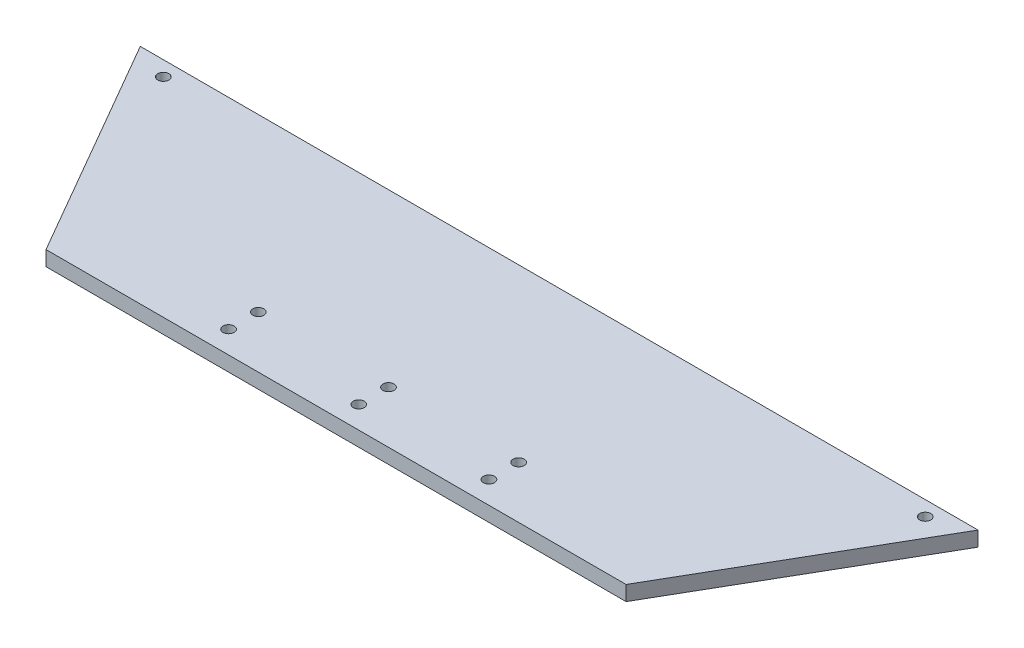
from build123d import *

# Parameters (mm, degrees)
EXTRUDE_1_DEPTH      = 4
SKETCH_6_R           = 1.5
CUT_EXTRUDE_5_DEPTH  = 20
SKETCH_7_R           = 1.5
CUT_EXTRUDE_10_DEPTH = 203.172047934


with BuildPart() as part:
    # Sketch 1 → Extrude 1 (new body)
    with BuildSketch(Plane(origin=(0, 0, 0), x_dir=(1, 0, 0), z_dir=(0, 1, 0))):
        Polygon((-78, 0), (78, 0), (112.641016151, 60), (-112.641016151, 60), align=None)
    extrude(amount=EXTRUDE_1_DEPTH)

    # Sketch 6 → Cut-Extrude 5 (cut)
    with BuildSketch(Plane(origin=(24.286369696, -3, 75), x_dir=(-1, 0, 0), z_dir=(0, -1, 0))):
        with Locations(Location((-78.169601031, 131, 0), (0, 0, 270))):
            Circle(SKETCH_6_R)
        with Locations(Location((126.742340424, 131, 0), (0, 0, 270))):
            Circle(SKETCH_6_R)
    extrude(amount=-CUT_EXTRUDE_5_DEPTH, mode=Mode.SUBTRACT)

    # Sketch 7 → Cut-Extrude 10 (cut, through all)
    with BuildSketch(Plane(origin=(0, -152.797762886, 0), x_dir=(-1, 0, 0), z_dir=(0, -1, 0))):
        with Locations(Location((-35.106818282, 14, 0), (0, 0, 90))):
            Circle(SKETCH_7_R)
        with Locations(Location((-0.106818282, 14, 0), (0, 0, 90))):
            Circle(SKETCH_7_R)
        with Locations(Location((34.893181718, 14, 0), (0, 0, 90))):
            Circle(SKETCH_7_R)
        with Locations(Location((34.893181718, 6, 0), (0, 0, 90))):
            Circle(SKETCH_7_R)
        with Locations(Location((-0.106818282, 6, 0), (0, 0, 90))):
            Circle(SKETCH_7_R)
        with Locations(Location((-35.106818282, 6, 0), (0, 0, 90))):
            Circle(SKETCH_7_R)
    extrude(amount=-CUT_EXTRUDE_10_DEPTH, mode=Mode.SUBTRACT)


solid = part.part
